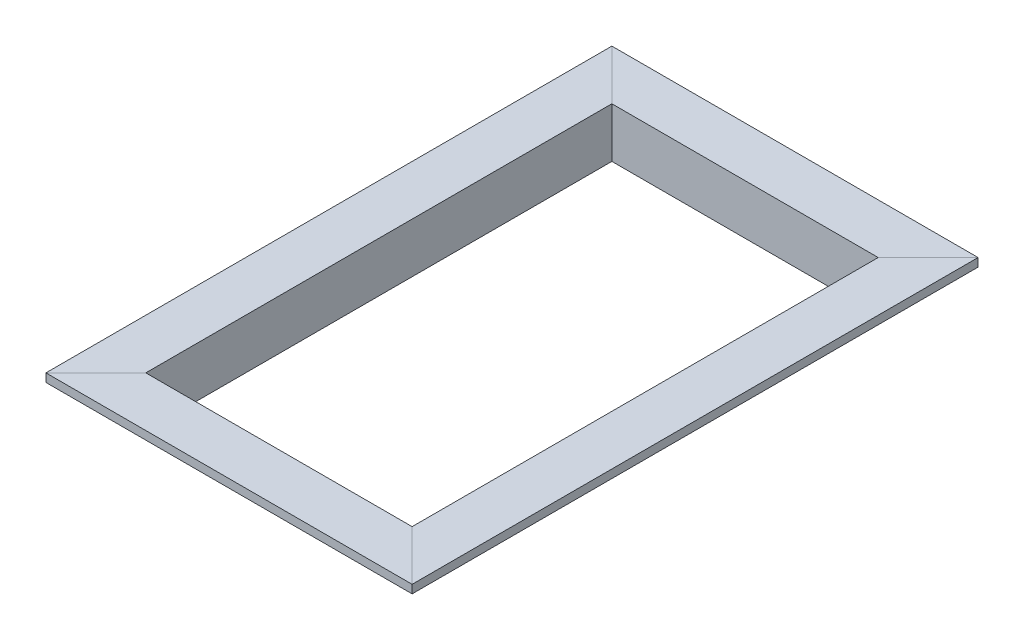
ISO-10303-21;
HEADER;
FILE_DESCRIPTION(('STEP AP214'),'2;1');
FILE_NAME('part.step','',(''),(''),'','','');
FILE_SCHEMA(('AUTOMOTIVE_DESIGN { 1 0 10303 214 1 1 1 1 }'));
ENDSEC;
DATA;
#1=APPLICATION_CONTEXT('core data for automotive mechanical design processes');
#2=APPLICATION_PROTOCOL_DEFINITION('international standard','automotive_design',2000,#1);
#3=PRODUCT_CONTEXT('',#1,'mechanical');
#4=PRODUCT('Part','Part','',(#3));
#5=PRODUCT_RELATED_PRODUCT_CATEGORY('part','',(#4));
#6=PRODUCT_DEFINITION_FORMATION('','',#4);
#7=PRODUCT_DEFINITION_CONTEXT('part definition',#1,'design');
#8=PRODUCT_DEFINITION('design','',#6,#7);
#9=PRODUCT_DEFINITION_SHAPE('','',#8);
#10=(LENGTH_UNIT() NAMED_UNIT(*) SI_UNIT(.MILLI.,.METRE.));
#11=(NAMED_UNIT(*) PLANE_ANGLE_UNIT() SI_UNIT($,.RADIAN.));
#12=(NAMED_UNIT(*) SI_UNIT($,.STERADIAN.) SOLID_ANGLE_UNIT());
#13=UNCERTAINTY_MEASURE_WITH_UNIT(LENGTH_MEASURE(1.E-05),#10,'distance_accuracy_value','');
#14=(GEOMETRIC_REPRESENTATION_CONTEXT(3) GLOBAL_UNCERTAINTY_ASSIGNED_CONTEXT((#13)) GLOBAL_UNIT_ASSIGNED_CONTEXT((#10,
#11,#12)) REPRESENTATION_CONTEXT('',''));
#15=CARTESIAN_POINT('',(0.,0.,0.));
#16=DIRECTION('',(0.,0.,1.));
#17=DIRECTION('',(1.,0.,0.));
#18=AXIS2_PLACEMENT_3D('',#15,#16,#17);
#19=CARTESIAN_POINT('',(0.,-3.175,88.9));
#20=DIRECTION('',(0.,1.,0.));
#21=DIRECTION('',(0.,0.,1.));
#22=AXIS2_PLACEMENT_3D('',#19,#20,#21);
#23=PLANE('',#22);
#24=DIRECTION('',(0.,0.,-1.));
#25=VECTOR('',#24,1.);
#26=CARTESIAN_POINT('',(15.875,-3.175,88.9));
#27=LINE('',#26,#25);
#28=CARTESIAN_POINT('',(15.875,-3.175,92.0390789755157));
#29=VERTEX_POINT('',#28);
#30=CARTESIAN_POINT('',(15.875,-3.175,-92.0390789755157));
#31=VERTEX_POINT('',#30);
#32=EDGE_CURVE('E131',#29,#31,#27,.T.);
#33=ORIENTED_EDGE('',*,*,#32,.F.);
#34=DIRECTION('',(-0.707106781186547,0.,0.707106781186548));
#35=VECTOR('',#34,1.);
#36=CARTESIAN_POINT('',(9.50703948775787,-3.175,98.4070394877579));
#37=LINE('',#36,#35);
#38=CARTESIAN_POINT('',(0.,-3.175,107.914078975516));
#39=VERTEX_POINT('',#38);
#40=EDGE_CURVE('E128',#29,#39,#37,.T.);
#41=ORIENTED_EDGE('',*,*,#40,.T.);
#42=DIRECTION('',(0.,0.,-1.));
#43=VECTOR('',#42,1.);
#44=CARTESIAN_POINT('',(0.,-3.175,88.9));
#45=LINE('',#44,#43);
#46=CARTESIAN_POINT('',(0.,-3.175,-107.914078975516));
#47=VERTEX_POINT('',#46);
#48=EDGE_CURVE('E130',#39,#47,#45,.T.);
#49=ORIENTED_EDGE('',*,*,#48,.T.);
#50=DIRECTION('',(0.707106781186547,0.,0.707106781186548));
#51=VECTOR('',#50,1.);
#52=CARTESIAN_POINT('',(98.4070394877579,-3.175,-9.5070394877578));
#53=LINE('',#52,#51);
#54=EDGE_CURVE('E133',#47,#31,#53,.T.);
#55=ORIENTED_EDGE('',*,*,#54,.T.);
#56=EDGE_LOOP('',(#33,#41,#49,#55));
#57=FACE_BOUND('',#56,.T.);
#58=ADVANCED_FACE('F43',(#57),#23,.F.);
#59=CARTESIAN_POINT('',(15.875,-19.05,88.9));
#60=DIRECTION('',(0.,1.,0.));
#61=DIRECTION('',(0.,0.,1.));
#62=AXIS2_PLACEMENT_3D('',#59,#60,#61);
#63=PLANE('',#62);
#64=DIRECTION('',(0.,0.,-1.));
#65=VECTOR('',#64,1.);
#66=CARTESIAN_POINT('',(19.05,-19.05,88.9));
#67=LINE('',#66,#65);
#68=CARTESIAN_POINT('',(19.05,-19.05,88.8640789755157));
#69=VERTEX_POINT('',#68);
#70=CARTESIAN_POINT('',(19.05,-19.05,-88.8640789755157));
#71=VERTEX_POINT('',#70);
#72=EDGE_CURVE('E94',#69,#71,#67,.T.);
#73=ORIENTED_EDGE('',*,*,#72,.F.);
#74=DIRECTION('',(-0.707106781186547,0.,0.707106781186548));
#75=VECTOR('',#74,1.);
#76=CARTESIAN_POINT('',(17.4445394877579,-19.05,90.4695394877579));
#77=LINE('',#76,#75);
#78=CARTESIAN_POINT('',(15.875,-19.05,92.0390789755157));
#79=VERTEX_POINT('',#78);
#80=EDGE_CURVE('E76',#69,#79,#77,.T.);
#81=ORIENTED_EDGE('',*,*,#80,.T.);
#82=DIRECTION('',(0.,0.,-1.));
#83=VECTOR('',#82,1.);
#84=CARTESIAN_POINT('',(15.875,-19.05,88.9));
#85=LINE('',#84,#83);
#86=CARTESIAN_POINT('',(15.875,-19.05,-92.0390789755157));
#87=VERTEX_POINT('',#86);
#88=EDGE_CURVE('E115',#79,#87,#85,.T.);
#89=ORIENTED_EDGE('',*,*,#88,.T.);
#90=DIRECTION('',(0.707106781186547,0.,0.707106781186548));
#91=VECTOR('',#90,1.);
#92=CARTESIAN_POINT('',(106.344539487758,-19.05,-1.56953948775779));
#93=LINE('',#92,#91);
#94=EDGE_CURVE('E108',#87,#71,#93,.T.);
#95=ORIENTED_EDGE('',*,*,#94,.T.);
#96=EDGE_LOOP('',(#73,#81,#89,#95));
#97=FACE_BOUND('',#96,.T.);
#98=ADVANCED_FACE('F113',(#97),#63,.F.);
#99=CARTESIAN_POINT('',(0.,0.,88.9));
#100=DIRECTION('',(0.,-1.,0.));
#101=DIRECTION('',(0.,0.,-1.));
#102=AXIS2_PLACEMENT_3D('',#99,#100,#101);
#103=PLANE('',#102);
#104=DIRECTION('',(0.,0.,-1.));
#105=VECTOR('',#104,1.);
#106=CARTESIAN_POINT('',(0.,0.,88.9));
#107=LINE('',#106,#105);
#108=CARTESIAN_POINT('',(0.,0.,107.914078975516));
#109=VERTEX_POINT('',#108);
#110=CARTESIAN_POINT('',(0.,0.,-107.914078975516));
#111=VERTEX_POINT('',#110);
#112=EDGE_CURVE('E127',#109,#111,#107,.T.);
#113=ORIENTED_EDGE('',*,*,#112,.F.);
#114=DIRECTION('',(-0.707106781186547,0.,0.707106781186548));
#115=VECTOR('',#114,1.);
#116=CARTESIAN_POINT('',(19.0320394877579,0.,88.8820394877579));
#117=LINE('',#116,#115);
#118=CARTESIAN_POINT('',(19.05,0.,88.8640789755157));
#119=VERTEX_POINT('',#118);
#120=EDGE_CURVE('E12',#119,#109,#117,.T.);
#121=ORIENTED_EDGE('',*,*,#120,.F.);
#122=DIRECTION('',(0.,0.,-1.));
#123=VECTOR('',#122,1.);
#124=CARTESIAN_POINT('',(19.05,0.,88.9));
#125=LINE('',#124,#123);
#126=CARTESIAN_POINT('',(19.05,0.,-88.8640789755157));
#127=VERTEX_POINT('',#126);
#128=EDGE_CURVE('E116',#119,#127,#125,.T.);
#129=ORIENTED_EDGE('',*,*,#128,.T.);
#130=DIRECTION('',(0.707106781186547,0.,0.707106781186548));
#131=VECTOR('',#130,1.);
#132=CARTESIAN_POINT('',(19.0320394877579,0.,-88.8820394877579));
#133=LINE('',#132,#131);
#134=EDGE_CURVE('E51',#111,#127,#133,.T.);
#135=ORIENTED_EDGE('',*,*,#134,.F.);
#136=EDGE_LOOP('',(#113,#121,#129,#135));
#137=FACE_BOUND('',#136,.T.);
#138=ADVANCED_FACE('F156',(#137),#103,.F.);
#139=CARTESIAN_POINT('',(0.,0.,88.9));
#140=DIRECTION('',(1.,0.,0.));
#141=DIRECTION('',(0.,0.,-1.));
#142=AXIS2_PLACEMENT_3D('',#139,#140,#141);
#143=PLANE('',#142);
#144=ORIENTED_EDGE('',*,*,#48,.F.);
#145=DIRECTION('',(0.,1.,0.));
#146=VECTOR('',#145,1.);
#147=CARTESIAN_POINT('',(0.,0.,107.914078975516));
#148=LINE('',#147,#146);
#149=EDGE_CURVE('E58',#39,#109,#148,.T.);
#150=ORIENTED_EDGE('',*,*,#149,.T.);
#151=ORIENTED_EDGE('',*,*,#112,.T.);
#152=DIRECTION('',(0.,-1.,0.));
#153=VECTOR('',#152,1.);
#154=CARTESIAN_POINT('',(0.,0.,-107.914078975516));
#155=LINE('',#154,#153);
#156=EDGE_CURVE('E132',#111,#47,#155,.T.);
#157=ORIENTED_EDGE('',*,*,#156,.T.);
#158=EDGE_LOOP('',(#144,#150,#151,#157));
#159=FACE_BOUND('',#158,.T.);
#160=ADVANCED_FACE('F152',(#159),#143,.F.);
#161=CARTESIAN_POINT('',(15.875,-3.175,88.9));
#162=DIRECTION('',(1.,0.,0.));
#163=DIRECTION('',(0.,0.,-1.));
#164=AXIS2_PLACEMENT_3D('',#161,#162,#163);
#165=PLANE('',#164);
#166=ORIENTED_EDGE('',*,*,#88,.F.);
#167=DIRECTION('',(0.,1.,0.));
#168=VECTOR('',#167,1.);
#169=CARTESIAN_POINT('',(15.875,-3.175,92.0390789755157));
#170=LINE('',#169,#168);
#171=EDGE_CURVE('E72',#79,#29,#170,.T.);
#172=ORIENTED_EDGE('',*,*,#171,.T.);
#173=ORIENTED_EDGE('',*,*,#32,.T.);
#174=DIRECTION('',(0.,-1.,0.));
#175=VECTOR('',#174,1.);
#176=CARTESIAN_POINT('',(15.875,-3.175,-92.0390789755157));
#177=LINE('',#176,#175);
#178=EDGE_CURVE('E122',#31,#87,#177,.T.);
#179=ORIENTED_EDGE('',*,*,#178,.T.);
#180=EDGE_LOOP('',(#166,#172,#173,#179));
#181=FACE_BOUND('',#180,.T.);
#182=ADVANCED_FACE('F149',(#181),#165,.F.);
#183=CARTESIAN_POINT('',(19.05,0.,88.9));
#184=DIRECTION('',(-1.,0.,0.));
#185=DIRECTION('',(0.,0.,1.));
#186=AXIS2_PLACEMENT_3D('',#183,#184,#185);
#187=PLANE('',#186);
#188=ORIENTED_EDGE('',*,*,#128,.F.);
#189=DIRECTION('',(0.,-1.,0.));
#190=VECTOR('',#189,1.);
#191=CARTESIAN_POINT('',(19.05,0.,88.8640789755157));
#192=LINE('',#191,#190);
#193=EDGE_CURVE('E99',#119,#69,#192,.T.);
#194=ORIENTED_EDGE('',*,*,#193,.T.);
#195=ORIENTED_EDGE('',*,*,#72,.T.);
#196=DIRECTION('',(0.,1.,0.));
#197=VECTOR('',#196,1.);
#198=CARTESIAN_POINT('',(19.05,0.,-88.8640789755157));
#199=LINE('',#198,#197);
#200=EDGE_CURVE('E98',#71,#127,#199,.T.);
#201=ORIENTED_EDGE('',*,*,#200,.T.);
#202=EDGE_LOOP('',(#188,#194,#195,#201));
#203=FACE_BOUND('',#202,.T.);
#204=ADVANCED_FACE('F97',(#203),#187,.F.);
#205=CARTESIAN_POINT('',(19.0320394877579,-19.050025,-88.8820394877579));
#206=DIRECTION('',(-0.707106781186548,0.,0.707106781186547));
#207=DIRECTION('',(0.707106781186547,0.,0.707106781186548));
#208=AXIS2_PLACEMENT_3D('',#205,#206,#207);
#209=PLANE('',#208);
#210=ORIENTED_EDGE('',*,*,#134,.T.);
#211=ORIENTED_EDGE('',*,*,#200,.F.);
#212=ORIENTED_EDGE('',*,*,#94,.F.);
#213=ORIENTED_EDGE('',*,*,#178,.F.);
#214=ORIENTED_EDGE('',*,*,#54,.F.);
#215=ORIENTED_EDGE('',*,*,#156,.F.);
#216=EDGE_LOOP('',(#210,#211,#212,#213,#214,#215));
#217=FACE_BOUND('',#216,.T.);
#218=ADVANCED_FACE('F106',(#217),#209,.F.);
#219=CARTESIAN_POINT('',(19.0320394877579,-19.050025,88.8820394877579));
#220=DIRECTION('',(-0.707106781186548,0.,-0.707106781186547));
#221=DIRECTION('',(-0.707106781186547,0.,0.707106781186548));
#222=AXIS2_PLACEMENT_3D('',#219,#220,#221);
#223=PLANE('',#222);
#224=ORIENTED_EDGE('',*,*,#40,.F.);
#225=ORIENTED_EDGE('',*,*,#171,.F.);
#226=ORIENTED_EDGE('',*,*,#80,.F.);
#227=ORIENTED_EDGE('',*,*,#193,.F.);
#228=ORIENTED_EDGE('',*,*,#120,.T.);
#229=ORIENTED_EDGE('',*,*,#149,.F.);
#230=EDGE_LOOP('',(#224,#225,#226,#227,#228,#229));
#231=FACE_BOUND('',#230,.T.);
#232=ADVANCED_FACE('F157',(#231),#223,.F.);
#233=CLOSED_SHELL('',(#58,#98,#138,#160,#182,#204,#218,#232));
#234=MANIFOLD_SOLID_BREP('B2',#233);
#235=CARTESIAN_POINT('',(139.682039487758,-19.050025,107.967960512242));
#236=DIRECTION('',(-0.707106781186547,0.,0.707106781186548));
#237=DIRECTION('',(0.707106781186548,0.,0.707106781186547));
#238=AXIS2_PLACEMENT_3D('',#235,#236,#237);
#239=PLANE('',#238);
#240=DIRECTION('',(0.,1.,0.));
#241=VECTOR('',#240,1.);
#242=CARTESIAN_POINT('',(120.614078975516,-144.167881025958,88.9));
#243=LINE('',#242,#241);
#244=CARTESIAN_POINT('',(120.614078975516,-19.05,88.9));
#245=VERTEX_POINT('',#244);
#246=CARTESIAN_POINT('',(120.614078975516,0.,88.9));
#247=VERTEX_POINT('',#246);
#248=EDGE_CURVE('E314',#245,#247,#243,.T.);
#249=ORIENTED_EDGE('',*,*,#248,.T.);
#250=DIRECTION('',(0.707106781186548,0.,0.707106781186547));
#251=VECTOR('',#250,1.);
#252=CARTESIAN_POINT('',(139.682039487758,0.,107.967960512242));
#253=LINE('',#252,#251);
#254=CARTESIAN_POINT('',(139.664078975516,0.,107.95));
#255=VERTEX_POINT('',#254);
#256=EDGE_CURVE('E332',#247,#255,#253,.T.);
#257=ORIENTED_EDGE('',*,*,#256,.T.);
#258=DIRECTION('',(0.,-1.,0.));
#259=VECTOR('',#258,1.);
#260=CARTESIAN_POINT('',(139.664078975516,-144.167881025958,107.95));
#261=LINE('',#260,#259);
#262=CARTESIAN_POINT('',(139.664078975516,-3.175,107.95));
#263=VERTEX_POINT('',#262);
#264=EDGE_CURVE('E285',#255,#263,#261,.T.);
#265=ORIENTED_EDGE('',*,*,#264,.T.);
#266=DIRECTION('',(0.707106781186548,0.,0.707106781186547));
#267=VECTOR('',#266,1.);
#268=CARTESIAN_POINT('',(60.3070394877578,-3.175,28.5929605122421));
#269=LINE('',#268,#267);
#270=CARTESIAN_POINT('',(123.789078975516,-3.175,92.075));
#271=VERTEX_POINT('',#270);
#272=EDGE_CURVE('E329',#271,#263,#269,.T.);
#273=ORIENTED_EDGE('',*,*,#272,.F.);
#274=DIRECTION('',(0.,1.,0.));
#275=VECTOR('',#274,1.);
#276=CARTESIAN_POINT('',(123.789078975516,-127.046681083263,92.075));
#277=LINE('',#276,#275);
#278=CARTESIAN_POINT('',(123.789078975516,-19.05,92.075));
#279=VERTEX_POINT('',#278);
#280=EDGE_CURVE('E354',#279,#271,#277,.T.);
#281=ORIENTED_EDGE('',*,*,#280,.F.);
#282=DIRECTION('',(0.707106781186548,0.,0.707106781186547));
#283=VECTOR('',#282,1.);
#284=CARTESIAN_POINT('',(68.2445394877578,-19.05,36.5304605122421));
#285=LINE('',#284,#283);
#286=EDGE_CURVE('E300',#245,#279,#285,.T.);
#287=ORIENTED_EDGE('',*,*,#286,.F.);
#288=EDGE_LOOP('',(#249,#257,#265,#273,#281,#287));
#289=FACE_BOUND('',#288,.T.);
#290=ADVANCED_FACE('F277',(#289),#239,.F.);
#291=CARTESIAN_POINT('',(0.,-144.167881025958,107.95));
#292=DIRECTION('',(0.,0.,1.));
#293=DIRECTION('',(1.,0.,0.));
#294=AXIS2_PLACEMENT_3D('',#291,#292,#293);
#295=PLANE('',#294);
#296=DIRECTION('',(0.,1.,0.));
#297=VECTOR('',#296,1.);
#298=CARTESIAN_POINT('',(0.0359210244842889,-144.167881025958,107.95));
#299=LINE('',#298,#297);
#300=CARTESIAN_POINT('',(0.0359210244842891,-3.175,107.95));
#301=VERTEX_POINT('',#300);
#302=CARTESIAN_POINT('',(0.0359210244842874,0.,107.95));
#303=VERTEX_POINT('',#302);
#304=EDGE_CURVE('E346',#301,#303,#299,.T.);
#305=ORIENTED_EDGE('',*,*,#304,.F.);
#306=DIRECTION('',(-1.,0.,0.));
#307=VECTOR('',#306,1.);
#308=CARTESIAN_POINT('',(0.,-3.17500000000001,107.95));
#309=LINE('',#308,#307);
#310=EDGE_CURVE('E340',#263,#301,#309,.T.);
#311=ORIENTED_EDGE('',*,*,#310,.F.);
#312=ORIENTED_EDGE('',*,*,#264,.F.);
#313=DIRECTION('',(1.,0.,0.));
#314=VECTOR('',#313,1.);
#315=CARTESIAN_POINT('',(0.,0.,107.95));
#316=LINE('',#315,#314);
#317=EDGE_CURVE('E348',#303,#255,#316,.T.);
#318=ORIENTED_EDGE('',*,*,#317,.F.);
#319=EDGE_LOOP('',(#305,#311,#312,#318));
#320=FACE_BOUND('',#319,.T.);
#321=ADVANCED_FACE('F345',(#320),#295,.T.);
#322=CARTESIAN_POINT('',(0.,-144.167881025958,88.9));
#323=DIRECTION('',(0.,0.,-1.));
#324=DIRECTION('',(-1.,0.,0.));
#325=AXIS2_PLACEMENT_3D('',#322,#323,#324);
#326=PLANE('',#325);
#327=DIRECTION('',(0.,-1.,0.));
#328=VECTOR('',#327,1.);
#329=CARTESIAN_POINT('',(19.0859210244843,-144.167881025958,88.9));
#330=LINE('',#329,#328);
#331=CARTESIAN_POINT('',(19.0859210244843,0.,88.9));
#332=VERTEX_POINT('',#331);
#333=CARTESIAN_POINT('',(19.0859210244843,-19.05,88.9));
#334=VERTEX_POINT('',#333);
#335=EDGE_CURVE('E343',#332,#334,#330,.T.);
#336=ORIENTED_EDGE('',*,*,#335,.F.);
#337=DIRECTION('',(-1.,0.,0.));
#338=VECTOR('',#337,1.);
#339=CARTESIAN_POINT('',(0.,0.,88.9));
#340=LINE('',#339,#338);
#341=EDGE_CURVE('E352',#247,#332,#340,.T.);
#342=ORIENTED_EDGE('',*,*,#341,.F.);
#343=ORIENTED_EDGE('',*,*,#248,.F.);
#344=DIRECTION('',(-1.,0.,0.));
#345=VECTOR('',#344,1.);
#346=CARTESIAN_POINT('',(15.875,-19.05,88.9));
#347=LINE('',#346,#345);
#348=EDGE_CURVE('E361',#245,#334,#347,.T.);
#349=ORIENTED_EDGE('',*,*,#348,.T.);
#350=EDGE_LOOP('',(#336,#342,#343,#349));
#351=FACE_BOUND('',#350,.T.);
#352=ADVANCED_FACE('F371',(#351),#326,.T.);
#353=CARTESIAN_POINT('',(0.,0.,88.9));
#354=DIRECTION('',(0.,-1.,0.));
#355=DIRECTION('',(0.,0.,-1.));
#356=AXIS2_PLACEMENT_3D('',#353,#354,#355);
#357=PLANE('',#356);
#358=ORIENTED_EDGE('',*,*,#341,.T.);
#359=DIRECTION('',(0.707106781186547,0.,-0.707106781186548));
#360=VECTOR('',#359,1.);
#361=CARTESIAN_POINT('',(19.0679605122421,0.,88.9179605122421));
#362=LINE('',#361,#360);
#363=EDGE_CURVE('E375',#303,#332,#362,.T.);
#364=ORIENTED_EDGE('',*,*,#363,.F.);
#365=ORIENTED_EDGE('',*,*,#317,.T.);
#366=ORIENTED_EDGE('',*,*,#256,.F.);
#367=EDGE_LOOP('',(#358,#364,#365,#366));
#368=FACE_BOUND('',#367,.T.);
#369=ADVANCED_FACE('F385',(#368),#357,.F.);
#370=CARTESIAN_POINT('',(15.875,-127.046681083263,92.075));
#371=DIRECTION('',(0.,0.,-1.));
#372=DIRECTION('',(-1.,0.,0.));
#373=AXIS2_PLACEMENT_3D('',#370,#371,#372);
#374=PLANE('',#373);
#375=DIRECTION('',(-1.,0.,0.));
#376=VECTOR('',#375,1.);
#377=CARTESIAN_POINT('',(15.875,-3.175,92.075));
#378=LINE('',#377,#376);
#379=CARTESIAN_POINT('',(15.9109210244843,-3.175,92.075));
#380=VERTEX_POINT('',#379);
#381=EDGE_CURVE('E342',#271,#380,#378,.T.);
#382=ORIENTED_EDGE('',*,*,#381,.T.);
#383=DIRECTION('',(0.,-1.,0.));
#384=VECTOR('',#383,1.);
#385=CARTESIAN_POINT('',(15.9109210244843,-127.046681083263,92.075));
#386=LINE('',#385,#384);
#387=CARTESIAN_POINT('',(15.9109210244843,-19.05,92.075));
#388=VERTEX_POINT('',#387);
#389=EDGE_CURVE('E41',#380,#388,#386,.T.);
#390=ORIENTED_EDGE('',*,*,#389,.T.);
#391=DIRECTION('',(1.,0.,0.));
#392=VECTOR('',#391,1.);
#393=CARTESIAN_POINT('',(15.875,-19.05,92.075));
#394=LINE('',#393,#392);
#395=EDGE_CURVE('E357',#388,#279,#394,.T.);
#396=ORIENTED_EDGE('',*,*,#395,.T.);
#397=ORIENTED_EDGE('',*,*,#280,.T.);
#398=EDGE_LOOP('',(#382,#390,#396,#397));
#399=FACE_BOUND('',#398,.T.);
#400=ADVANCED_FACE('F387',(#399),#374,.F.);
#401=CARTESIAN_POINT('',(15.875,-19.05,88.9));
#402=DIRECTION('',(0.,1.,0.));
#403=DIRECTION('',(0.,0.,1.));
#404=AXIS2_PLACEMENT_3D('',#401,#402,#403);
#405=PLANE('',#404);
#406=ORIENTED_EDGE('',*,*,#395,.F.);
#407=DIRECTION('',(0.707106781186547,0.,-0.707106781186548));
#408=VECTOR('',#407,1.);
#409=CARTESIAN_POINT('',(17.4804605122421,-19.05,90.5054605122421));
#410=LINE('',#409,#408);
#411=EDGE_CURVE('E292',#388,#334,#410,.T.);
#412=ORIENTED_EDGE('',*,*,#411,.T.);
#413=ORIENTED_EDGE('',*,*,#348,.F.);
#414=ORIENTED_EDGE('',*,*,#286,.T.);
#415=EDGE_LOOP('',(#406,#412,#413,#414));
#416=FACE_BOUND('',#415,.T.);
#417=ADVANCED_FACE('F374',(#416),#405,.F.);
#418=CARTESIAN_POINT('',(0.,-3.175,88.9));
#419=DIRECTION('',(0.,1.,0.));
#420=DIRECTION('',(0.,0.,1.));
#421=AXIS2_PLACEMENT_3D('',#418,#419,#420);
#422=PLANE('',#421);
#423=ORIENTED_EDGE('',*,*,#310,.T.);
#424=DIRECTION('',(0.707106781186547,0.,-0.707106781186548));
#425=VECTOR('',#424,1.);
#426=CARTESIAN_POINT('',(9.54296051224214,-3.175,98.4429605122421));
#427=LINE('',#426,#425);
#428=EDGE_CURVE('E321',#301,#380,#427,.T.);
#429=ORIENTED_EDGE('',*,*,#428,.T.);
#430=ORIENTED_EDGE('',*,*,#381,.F.);
#431=ORIENTED_EDGE('',*,*,#272,.T.);
#432=EDGE_LOOP('',(#423,#429,#430,#431));
#433=FACE_BOUND('',#432,.T.);
#434=ADVANCED_FACE('F279',(#433),#422,.F.);
#435=CARTESIAN_POINT('',(19.0679605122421,-19.050025,88.9179605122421));
#436=DIRECTION('',(0.707106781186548,0.,0.707106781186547));
#437=DIRECTION('',(0.707106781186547,0.,-0.707106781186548));
#438=AXIS2_PLACEMENT_3D('',#435,#436,#437);
#439=PLANE('',#438);
#440=ORIENTED_EDGE('',*,*,#335,.T.);
#441=ORIENTED_EDGE('',*,*,#411,.F.);
#442=ORIENTED_EDGE('',*,*,#389,.F.);
#443=ORIENTED_EDGE('',*,*,#428,.F.);
#444=ORIENTED_EDGE('',*,*,#304,.T.);
#445=ORIENTED_EDGE('',*,*,#363,.T.);
#446=EDGE_LOOP('',(#440,#441,#442,#443,#444,#445));
#447=FACE_BOUND('',#446,.T.);
#448=ADVANCED_FACE('F382',(#447),#439,.F.);
#449=CLOSED_SHELL('',(#290,#321,#352,#369,#400,#417,#434,#448));
#450=MANIFOLD_SOLID_BREP('B6',#449);
#451=CARTESIAN_POINT('',(120.667960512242,-19.050025,-88.8820394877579));
#452=DIRECTION('',(0.707106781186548,0.,0.707106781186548));
#453=DIRECTION('',(0.707106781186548,0.,-0.707106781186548));
#454=AXIS2_PLACEMENT_3D('',#451,#452,#453);
#455=PLANE('',#454);
#456=DIRECTION('',(0.,-1.,0.));
#457=VECTOR('',#456,1.);
#458=CARTESIAN_POINT('',(139.7,-144.167881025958,-107.914078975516));
#459=LINE('',#458,#457);
#460=CARTESIAN_POINT('',(139.7,0.,-107.914078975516));
#461=VERTEX_POINT('',#460);
#462=CARTESIAN_POINT('',(139.7,-3.175,-107.914078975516));
#463=VERTEX_POINT('',#462);
#464=EDGE_CURVE('E567',#461,#463,#459,.T.);
#465=ORIENTED_EDGE('',*,*,#464,.T.);
#466=DIRECTION('',(0.707106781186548,0.,-0.707106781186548));
#467=VECTOR('',#466,1.);
#468=CARTESIAN_POINT('',(-28.5570394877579,-3.175,60.3429605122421));
#469=LINE('',#468,#467);
#470=CARTESIAN_POINT('',(123.825,-3.17499999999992,-92.0390789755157));
#471=VERTEX_POINT('',#470);
#472=EDGE_CURVE('E579',#471,#463,#469,.T.);
#473=ORIENTED_EDGE('',*,*,#472,.F.);
#474=DIRECTION('',(0.,1.,0.));
#475=VECTOR('',#474,1.);
#476=CARTESIAN_POINT('',(123.825,-3.1749999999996,-92.0390789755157));
#477=LINE('',#476,#475);
#478=CARTESIAN_POINT('',(123.825,-19.05,-92.0390789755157));
#479=VERTEX_POINT('',#478);
#480=EDGE_CURVE('E577',#479,#471,#477,.T.);
#481=ORIENTED_EDGE('',*,*,#480,.F.);
#482=DIRECTION('',(0.707106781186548,0.,-0.707106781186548));
#483=VECTOR('',#482,1.);
#484=CARTESIAN_POINT('',(-20.6195394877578,-19.05,52.4054605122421));
#485=LINE('',#484,#483);
#486=CARTESIAN_POINT('',(120.65,-19.05,-88.8640789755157));
#487=VERTEX_POINT('',#486);
#488=EDGE_CURVE('E568',#487,#479,#485,.T.);
#489=ORIENTED_EDGE('',*,*,#488,.F.);
#490=DIRECTION('',(0.,-1.,0.));
#491=VECTOR('',#490,1.);
#492=CARTESIAN_POINT('',(120.65,3.33014570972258E-13,-88.8640789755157));
#493=LINE('',#492,#491);
#494=CARTESIAN_POINT('',(120.65,0.,-88.8640789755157));
#495=VERTEX_POINT('',#494);
#496=EDGE_CURVE('E570',#495,#487,#493,.T.);
#497=ORIENTED_EDGE('',*,*,#496,.F.);
#498=DIRECTION('',(0.707106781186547,0.,-0.707106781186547));
#499=VECTOR('',#498,1.);
#500=CARTESIAN_POINT('',(120.667960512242,0.,-88.8820394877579));
#501=LINE('',#500,#499);
#502=EDGE_CURVE('E505',#495,#461,#501,.T.);
#503=ORIENTED_EDGE('',*,*,#502,.T.);
#504=EDGE_LOOP('',(#465,#473,#481,#489,#497,#503));
#505=FACE_BOUND('',#504,.T.);
#506=ADVANCED_FACE('F497',(#505),#455,.F.);
#507=CARTESIAN_POINT('',(139.7,-144.167881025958,-88.9));
#508=DIRECTION('',(1.,0.,0.));
#509=DIRECTION('',(0.,0.,-1.));
#510=AXIS2_PLACEMENT_3D('',#507,#508,#509);
#511=PLANE('',#510);
#512=DIRECTION('',(0.,1.,0.));
#513=VECTOR('',#512,1.);
#514=CARTESIAN_POINT('',(139.7,-144.167881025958,107.914078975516));
#515=LINE('',#514,#513);
#516=CARTESIAN_POINT('',(139.7,-3.175,107.914078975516));
#517=VERTEX_POINT('',#516);
#518=CARTESIAN_POINT('',(139.7,0.,107.914078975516));
#519=VERTEX_POINT('',#518);
#520=EDGE_CURVE('E549',#517,#519,#515,.T.);
#521=ORIENTED_EDGE('',*,*,#520,.F.);
#522=DIRECTION('',(0.,0.,1.));
#523=VECTOR('',#522,1.);
#524=CARTESIAN_POINT('',(139.7,-3.17500000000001,-88.9));
#525=LINE('',#524,#523);
#526=EDGE_CURVE('E578',#463,#517,#525,.T.);
#527=ORIENTED_EDGE('',*,*,#526,.F.);
#528=ORIENTED_EDGE('',*,*,#464,.F.);
#529=DIRECTION('',(0.,0.,-1.));
#530=VECTOR('',#529,1.);
#531=CARTESIAN_POINT('',(139.7,0.,-88.9));
#532=LINE('',#531,#530);
#533=EDGE_CURVE('E520',#519,#461,#532,.T.);
#534=ORIENTED_EDGE('',*,*,#533,.F.);
#535=EDGE_LOOP('',(#521,#527,#528,#534));
#536=FACE_BOUND('',#535,.T.);
#537=ADVANCED_FACE('F566',(#536),#511,.T.);
#538=CARTESIAN_POINT('',(120.65,0.,88.9));
#539=DIRECTION('',(1.,0.,0.));
#540=DIRECTION('',(0.,1.,0.));
#541=AXIS2_PLACEMENT_3D('',#538,#539,#540);
#542=PLANE('',#541);
#543=DIRECTION('',(0.,0.,-1.));
#544=VECTOR('',#543,1.);
#545=CARTESIAN_POINT('',(120.65,-19.0499999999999,88.9));
#546=LINE('',#545,#544);
#547=CARTESIAN_POINT('',(120.65,-19.05,88.8640789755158));
#548=VERTEX_POINT('',#547);
#549=EDGE_CURVE('E573',#548,#487,#546,.T.);
#550=ORIENTED_EDGE('',*,*,#549,.F.);
#551=DIRECTION('',(0.,1.,0.));
#552=VECTOR('',#551,1.);
#553=CARTESIAN_POINT('',(120.65,0.,88.8640789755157));
#554=LINE('',#553,#552);
#555=CARTESIAN_POINT('',(120.65,0.,88.8640789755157));
#556=VERTEX_POINT('',#555);
#557=EDGE_CURVE('E559',#548,#556,#554,.T.);
#558=ORIENTED_EDGE('',*,*,#557,.T.);
#559=DIRECTION('',(0.,0.,-1.));
#560=VECTOR('',#559,1.);
#561=CARTESIAN_POINT('',(120.65,0.,88.9));
#562=LINE('',#561,#560);
#563=EDGE_CURVE('E563',#556,#495,#562,.T.);
#564=ORIENTED_EDGE('',*,*,#563,.T.);
#565=ORIENTED_EDGE('',*,*,#496,.T.);
#566=EDGE_LOOP('',(#550,#558,#564,#565));
#567=FACE_BOUND('',#566,.T.);
#568=ADVANCED_FACE('F596',(#567),#542,.F.);
#569=CARTESIAN_POINT('',(0.,0.,88.9));
#570=DIRECTION('',(0.,-1.,0.));
#571=DIRECTION('',(0.,0.,-1.));
#572=AXIS2_PLACEMENT_3D('',#569,#570,#571);
#573=PLANE('',#572);
#574=ORIENTED_EDGE('',*,*,#563,.F.);
#575=DIRECTION('',(-0.707106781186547,0.,-0.707106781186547));
#576=VECTOR('',#575,1.);
#577=CARTESIAN_POINT('',(120.667960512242,0.,88.8820394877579));
#578=LINE('',#577,#576);
#579=EDGE_CURVE('E551',#519,#556,#578,.T.);
#580=ORIENTED_EDGE('',*,*,#579,.F.);
#581=ORIENTED_EDGE('',*,*,#533,.T.);
#582=ORIENTED_EDGE('',*,*,#502,.F.);
#583=EDGE_LOOP('',(#574,#580,#581,#582));
#584=FACE_BOUND('',#583,.T.);
#585=ADVANCED_FACE('F562',(#584),#573,.F.);
#586=CARTESIAN_POINT('',(123.825,-3.17499999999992,88.9));
#587=DIRECTION('',(-1.,0.,0.));
#588=DIRECTION('',(0.,-1.,0.));
#589=AXIS2_PLACEMENT_3D('',#586,#587,#588);
#590=PLANE('',#589);
#591=DIRECTION('',(0.,0.,-1.));
#592=VECTOR('',#591,1.);
#593=CARTESIAN_POINT('',(123.825,-3.17499999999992,88.9));
#594=LINE('',#593,#592);
#595=CARTESIAN_POINT('',(123.825,-3.175,92.0390789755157));
#596=VERTEX_POINT('',#595);
#597=EDGE_CURVE('E558',#596,#471,#594,.T.);
#598=ORIENTED_EDGE('',*,*,#597,.F.);
#599=DIRECTION('',(0.,-1.,0.));
#600=VECTOR('',#599,1.);
#601=CARTESIAN_POINT('',(123.825,-3.17499999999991,92.0390789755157));
#602=LINE('',#601,#600);
#603=CARTESIAN_POINT('',(123.825,-19.0499999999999,92.0390789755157));
#604=VERTEX_POINT('',#603);
#605=EDGE_CURVE('E275',#596,#604,#602,.T.);
#606=ORIENTED_EDGE('',*,*,#605,.T.);
#607=DIRECTION('',(0.,0.,-1.));
#608=VECTOR('',#607,1.);
#609=CARTESIAN_POINT('',(123.825,-19.0499999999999,88.9));
#610=LINE('',#609,#608);
#611=EDGE_CURVE('E582',#604,#479,#610,.T.);
#612=ORIENTED_EDGE('',*,*,#611,.T.);
#613=ORIENTED_EDGE('',*,*,#480,.T.);
#614=EDGE_LOOP('',(#598,#606,#612,#613));
#615=FACE_BOUND('',#614,.T.);
#616=ADVANCED_FACE('F606',(#615),#590,.F.);
#617=CARTESIAN_POINT('',(15.875,-19.05,88.9));
#618=DIRECTION('',(0.,1.,0.));
#619=DIRECTION('',(0.,0.,1.));
#620=AXIS2_PLACEMENT_3D('',#617,#618,#619);
#621=PLANE('',#620);
#622=ORIENTED_EDGE('',*,*,#611,.F.);
#623=DIRECTION('',(-0.707106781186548,0.,-0.707106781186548));
#624=VECTOR('',#623,1.);
#625=CARTESIAN_POINT('',(68.2804605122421,-19.05,36.4945394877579));
#626=LINE('',#625,#624);
#627=EDGE_CURVE('E512',#604,#548,#626,.T.);
#628=ORIENTED_EDGE('',*,*,#627,.T.);
#629=ORIENTED_EDGE('',*,*,#549,.T.);
#630=ORIENTED_EDGE('',*,*,#488,.T.);
#631=EDGE_LOOP('',(#622,#628,#629,#630));
#632=FACE_BOUND('',#631,.T.);
#633=ADVANCED_FACE('F602',(#632),#621,.F.);
#634=CARTESIAN_POINT('',(0.,-3.175,88.9));
#635=DIRECTION('',(0.,1.,0.));
#636=DIRECTION('',(0.,0.,1.));
#637=AXIS2_PLACEMENT_3D('',#634,#635,#636);
#638=PLANE('',#637);
#639=ORIENTED_EDGE('',*,*,#526,.T.);
#640=DIRECTION('',(-0.707106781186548,0.,-0.707106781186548));
#641=VECTOR('',#640,1.);
#642=CARTESIAN_POINT('',(60.3429605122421,-3.175,28.5570394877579));
#643=LINE('',#642,#641);
#644=EDGE_CURVE('E554',#517,#596,#643,.T.);
#645=ORIENTED_EDGE('',*,*,#644,.T.);
#646=ORIENTED_EDGE('',*,*,#597,.T.);
#647=ORIENTED_EDGE('',*,*,#472,.T.);
#648=EDGE_LOOP('',(#639,#645,#646,#647));
#649=FACE_BOUND('',#648,.T.);
#650=ADVANCED_FACE('F499',(#649),#638,.F.);
#651=CARTESIAN_POINT('',(120.667960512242,-19.050025,88.8820394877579));
#652=DIRECTION('',(0.707106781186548,0.,-0.707106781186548));
#653=DIRECTION('',(-0.707106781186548,0.,-0.707106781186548));
#654=AXIS2_PLACEMENT_3D('',#651,#652,#653);
#655=PLANE('',#654);
#656=ORIENTED_EDGE('',*,*,#520,.T.);
#657=ORIENTED_EDGE('',*,*,#579,.T.);
#658=ORIENTED_EDGE('',*,*,#557,.F.);
#659=ORIENTED_EDGE('',*,*,#627,.F.);
#660=ORIENTED_EDGE('',*,*,#605,.F.);
#661=ORIENTED_EDGE('',*,*,#644,.F.);
#662=EDGE_LOOP('',(#656,#657,#658,#659,#660,#661));
#663=FACE_BOUND('',#662,.T.);
#664=ADVANCED_FACE('F550',(#663),#655,.F.);
#665=CLOSED_SHELL('',(#506,#537,#568,#585,#616,#633,#650,#664));
#666=MANIFOLD_SOLID_BREP('B35',#665);
#667=CARTESIAN_POINT('',(0.0179605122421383,-19.050025,-107.967960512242));
#668=DIRECTION('',(0.707106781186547,0.,-0.707106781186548));
#669=DIRECTION('',(-0.707106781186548,0.,-0.707106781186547));
#670=AXIS2_PLACEMENT_3D('',#667,#668,#669);
#671=PLANE('',#670);
#672=DIRECTION('',(0.,-1.,0.));
#673=VECTOR('',#672,1.);
#674=CARTESIAN_POINT('',(0.0359210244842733,-144.167881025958,-107.95));
#675=LINE('',#674,#673);
#676=CARTESIAN_POINT('',(0.0359210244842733,0.,-107.95));
#677=VERTEX_POINT('',#676);
#678=CARTESIAN_POINT('',(0.0359210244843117,-3.175,-107.95));
#679=VERTEX_POINT('',#678);
#680=EDGE_CURVE('E792',#677,#679,#675,.T.);
#681=ORIENTED_EDGE('',*,*,#680,.T.);
#682=DIRECTION('',(-0.707106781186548,0.,-0.707106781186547));
#683=VECTOR('',#682,1.);
#684=CARTESIAN_POINT('',(98.4429605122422,-3.175,-9.54296051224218));
#685=LINE('',#684,#683);
#686=CARTESIAN_POINT('',(15.9109210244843,-3.175,-92.075));
#687=VERTEX_POINT('',#686);
#688=EDGE_CURVE('E739',#687,#679,#685,.T.);
#689=ORIENTED_EDGE('',*,*,#688,.F.);
#690=DIRECTION('',(0.,1.,0.));
#691=VECTOR('',#690,1.);
#692=CARTESIAN_POINT('',(15.9109210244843,-127.046681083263,-92.075));
#693=LINE('',#692,#691);
#694=CARTESIAN_POINT('',(15.9109210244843,-19.05,-92.075));
#695=VERTEX_POINT('',#694);
#696=EDGE_CURVE('E725',#695,#687,#693,.T.);
#697=ORIENTED_EDGE('',*,*,#696,.F.);
#698=DIRECTION('',(-0.707106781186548,0.,-0.707106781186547));
#699=VECTOR('',#698,1.);
#700=CARTESIAN_POINT('',(106.380460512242,-19.05,-1.60546051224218));
#701=LINE('',#700,#699);
#702=CARTESIAN_POINT('',(19.0859210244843,-19.05,-88.9));
#703=VERTEX_POINT('',#702);
#704=EDGE_CURVE('E818',#703,#695,#701,.T.);
#705=ORIENTED_EDGE('',*,*,#704,.F.);
#706=DIRECTION('',(0.,1.,0.));
#707=VECTOR('',#706,1.);
#708=CARTESIAN_POINT('',(19.0859210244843,-144.167881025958,-88.9));
#709=LINE('',#708,#707);
#710=CARTESIAN_POINT('',(19.0859210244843,0.,-88.9));
#711=VERTEX_POINT('',#710);
#712=EDGE_CURVE('E816',#703,#711,#709,.T.);
#713=ORIENTED_EDGE('',*,*,#712,.T.);
#714=DIRECTION('',(-0.707106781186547,0.,-0.707106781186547));
#715=VECTOR('',#714,1.);
#716=CARTESIAN_POINT('',(0.0179605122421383,0.,-107.967960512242));
#717=LINE('',#716,#715);
#718=EDGE_CURVE('E779',#711,#677,#717,.T.);
#719=ORIENTED_EDGE('',*,*,#718,.T.);
#720=EDGE_LOOP('',(#681,#689,#697,#705,#713,#719));
#721=FACE_BOUND('',#720,.T.);
#722=ADVANCED_FACE('F717',(#721),#671,.F.);
#723=CARTESIAN_POINT('',(15.875,-127.046681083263,-92.075));
#724=DIRECTION('',(0.,0.,1.));
#725=DIRECTION('',(1.,0.,0.));
#726=AXIS2_PLACEMENT_3D('',#723,#724,#725);
#727=PLANE('',#726);
#728=DIRECTION('',(1.,0.,0.));
#729=VECTOR('',#728,1.);
#730=CARTESIAN_POINT('',(15.875,-3.175,-92.075));
#731=LINE('',#730,#729);
#732=CARTESIAN_POINT('',(123.789078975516,-3.175,-92.075));
#733=VERTEX_POINT('',#732);
#734=EDGE_CURVE('E804',#687,#733,#731,.T.);
#735=ORIENTED_EDGE('',*,*,#734,.T.);
#736=DIRECTION('',(0.,-1.,0.));
#737=VECTOR('',#736,1.);
#738=CARTESIAN_POINT('',(123.789078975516,-127.046681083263,-92.075));
#739=LINE('',#738,#737);
#740=CARTESIAN_POINT('',(123.789078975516,-19.05,-92.075));
#741=VERTEX_POINT('',#740);
#742=EDGE_CURVE('E495',#733,#741,#739,.T.);
#743=ORIENTED_EDGE('',*,*,#742,.T.);
#744=DIRECTION('',(-1.,0.,0.));
#745=VECTOR('',#744,1.);
#746=CARTESIAN_POINT('',(15.875,-19.05,-92.075));
#747=LINE('',#746,#745);
#748=EDGE_CURVE('E796',#741,#695,#747,.T.);
#749=ORIENTED_EDGE('',*,*,#748,.T.);
#750=ORIENTED_EDGE('',*,*,#696,.T.);
#751=EDGE_LOOP('',(#735,#743,#749,#750));
#752=FACE_BOUND('',#751,.T.);
#753=ADVANCED_FACE('F803',(#752),#727,.F.);
#754=CARTESIAN_POINT('',(15.875,-19.05,88.9));
#755=DIRECTION('',(0.,1.,0.));
#756=DIRECTION('',(0.,0.,1.));
#757=AXIS2_PLACEMENT_3D('',#754,#755,#756);
#758=PLANE('',#757);
#759=ORIENTED_EDGE('',*,*,#748,.F.);
#760=DIRECTION('',(-0.707106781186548,0.,0.707106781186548));
#761=VECTOR('',#760,1.);
#762=CARTESIAN_POINT('',(-20.6554605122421,-19.05,52.3695394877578));
#763=LINE('',#762,#761);
#764=CARTESIAN_POINT('',(120.614078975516,-19.05,-88.9));
#765=VERTEX_POINT('',#764);
#766=EDGE_CURVE('E732',#741,#765,#763,.T.);
#767=ORIENTED_EDGE('',*,*,#766,.T.);
#768=DIRECTION('',(1.,0.,0.));
#769=VECTOR('',#768,1.);
#770=CARTESIAN_POINT('',(15.875,-19.05,-88.9));
#771=LINE('',#770,#769);
#772=EDGE_CURVE('E808',#703,#765,#771,.T.);
#773=ORIENTED_EDGE('',*,*,#772,.F.);
#774=ORIENTED_EDGE('',*,*,#704,.T.);
#775=EDGE_LOOP('',(#759,#767,#773,#774));
#776=FACE_BOUND('',#775,.T.);
#777=ADVANCED_FACE('F826',(#776),#758,.F.);
#778=CARTESIAN_POINT('',(0.,-144.167881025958,-107.95));
#779=DIRECTION('',(0.,0.,-1.));
#780=DIRECTION('',(-1.,0.,0.));
#781=AXIS2_PLACEMENT_3D('',#778,#779,#780);
#782=PLANE('',#781);
#783=DIRECTION('',(0.,1.,0.));
#784=VECTOR('',#783,1.);
#785=CARTESIAN_POINT('',(139.664078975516,-144.167881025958,-107.95));
#786=LINE('',#785,#784);
#787=CARTESIAN_POINT('',(139.664078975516,-3.175,-107.95));
#788=VERTEX_POINT('',#787);
#789=CARTESIAN_POINT('',(139.664078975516,0.,-107.95));
#790=VERTEX_POINT('',#789);
#791=EDGE_CURVE('E768',#788,#790,#786,.T.);
#792=ORIENTED_EDGE('',*,*,#791,.F.);
#793=DIRECTION('',(1.,0.,0.));
#794=VECTOR('',#793,1.);
#795=CARTESIAN_POINT('',(0.,-3.17500000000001,-107.95));
#796=LINE('',#795,#794);
#797=EDGE_CURVE('E793',#679,#788,#796,.T.);
#798=ORIENTED_EDGE('',*,*,#797,.F.);
#799=ORIENTED_EDGE('',*,*,#680,.F.);
#800=DIRECTION('',(-1.,0.,0.));
#801=VECTOR('',#800,1.);
#802=CARTESIAN_POINT('',(0.,0.,-107.95));
#803=LINE('',#802,#801);
#804=EDGE_CURVE('E785',#790,#677,#803,.T.);
#805=ORIENTED_EDGE('',*,*,#804,.F.);
#806=EDGE_LOOP('',(#792,#798,#799,#805));
#807=FACE_BOUND('',#806,.T.);
#808=ADVANCED_FACE('F791',(#807),#782,.T.);
#809=CARTESIAN_POINT('',(0.,0.,88.9));
#810=DIRECTION('',(0.,-1.,0.));
#811=DIRECTION('',(0.,0.,-1.));
#812=AXIS2_PLACEMENT_3D('',#809,#810,#811);
#813=PLANE('',#812);
#814=DIRECTION('',(1.,0.,0.));
#815=VECTOR('',#814,1.);
#816=CARTESIAN_POINT('',(0.,0.,-88.9));
#817=LINE('',#816,#815);
#818=CARTESIAN_POINT('',(120.614078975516,0.,-88.9));
#819=VERTEX_POINT('',#818);
#820=EDGE_CURVE('E788',#711,#819,#817,.T.);
#821=ORIENTED_EDGE('',*,*,#820,.T.);
#822=DIRECTION('',(-0.707106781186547,0.,0.707106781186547));
#823=VECTOR('',#822,1.);
#824=CARTESIAN_POINT('',(120.632039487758,0.,-88.9179605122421));
#825=LINE('',#824,#823);
#826=EDGE_CURVE('E771',#790,#819,#825,.T.);
#827=ORIENTED_EDGE('',*,*,#826,.F.);
#828=ORIENTED_EDGE('',*,*,#804,.T.);
#829=ORIENTED_EDGE('',*,*,#718,.F.);
#830=EDGE_LOOP('',(#821,#827,#828,#829));
#831=FACE_BOUND('',#830,.T.);
#832=ADVANCED_FACE('F783',(#831),#813,.F.);
#833=CARTESIAN_POINT('',(0.,-144.167881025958,-88.9));
#834=DIRECTION('',(0.,0.,1.));
#835=DIRECTION('',(1.,0.,0.));
#836=AXIS2_PLACEMENT_3D('',#833,#834,#835);
#837=PLANE('',#836);
#838=DIRECTION('',(0.,-1.,0.));
#839=VECTOR('',#838,1.);
#840=CARTESIAN_POINT('',(120.614078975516,-144.167881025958,-88.9));
#841=LINE('',#840,#839);
#842=EDGE_CURVE('E822',#819,#765,#841,.T.);
#843=ORIENTED_EDGE('',*,*,#842,.F.);
#844=ORIENTED_EDGE('',*,*,#820,.F.);
#845=ORIENTED_EDGE('',*,*,#712,.F.);
#846=ORIENTED_EDGE('',*,*,#772,.T.);
#847=EDGE_LOOP('',(#843,#844,#845,#846));
#848=FACE_BOUND('',#847,.T.);
#849=ADVANCED_FACE('F829',(#848),#837,.T.);
#850=CARTESIAN_POINT('',(0.,-3.175,88.9));
#851=DIRECTION('',(0.,1.,0.));
#852=DIRECTION('',(0.,0.,1.));
#853=AXIS2_PLACEMENT_3D('',#850,#851,#852);
#854=PLANE('',#853);
#855=ORIENTED_EDGE('',*,*,#797,.T.);
#856=DIRECTION('',(-0.707106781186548,0.,0.707106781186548));
#857=VECTOR('',#856,1.);
#858=CARTESIAN_POINT('',(-28.5929605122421,-3.175,60.3070394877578));
#859=LINE('',#858,#857);
#860=EDGE_CURVE('E774',#788,#733,#859,.T.);
#861=ORIENTED_EDGE('',*,*,#860,.T.);
#862=ORIENTED_EDGE('',*,*,#734,.F.);
#863=ORIENTED_EDGE('',*,*,#688,.T.);
#864=EDGE_LOOP('',(#855,#861,#862,#863));
#865=FACE_BOUND('',#864,.T.);
#866=ADVANCED_FACE('F719',(#865),#854,.F.);
#867=CARTESIAN_POINT('',(120.632039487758,-19.050025,-88.9179605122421));
#868=DIRECTION('',(-0.707106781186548,0.,-0.707106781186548));
#869=DIRECTION('',(-0.707106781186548,0.,0.707106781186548));
#870=AXIS2_PLACEMENT_3D('',#867,#868,#869);
#871=PLANE('',#870);
#872=ORIENTED_EDGE('',*,*,#791,.T.);
#873=ORIENTED_EDGE('',*,*,#826,.T.);
#874=ORIENTED_EDGE('',*,*,#842,.T.);
#875=ORIENTED_EDGE('',*,*,#766,.F.);
#876=ORIENTED_EDGE('',*,*,#742,.F.);
#877=ORIENTED_EDGE('',*,*,#860,.F.);
#878=EDGE_LOOP('',(#872,#873,#874,#875,#876,#877));
#879=FACE_BOUND('',#878,.T.);
#880=ADVANCED_FACE('F770',(#879),#871,.F.);
#881=CLOSED_SHELL('',(#722,#753,#777,#808,#832,#849,#866,#880));
#882=MANIFOLD_SOLID_BREP('B269',#881);
#883=ADVANCED_BREP_SHAPE_REPRESENTATION('',(#18,#234,#450,#666,#882),#14);
#884=SHAPE_DEFINITION_REPRESENTATION(#9,#883);
ENDSEC;
END-ISO-10303-21;
